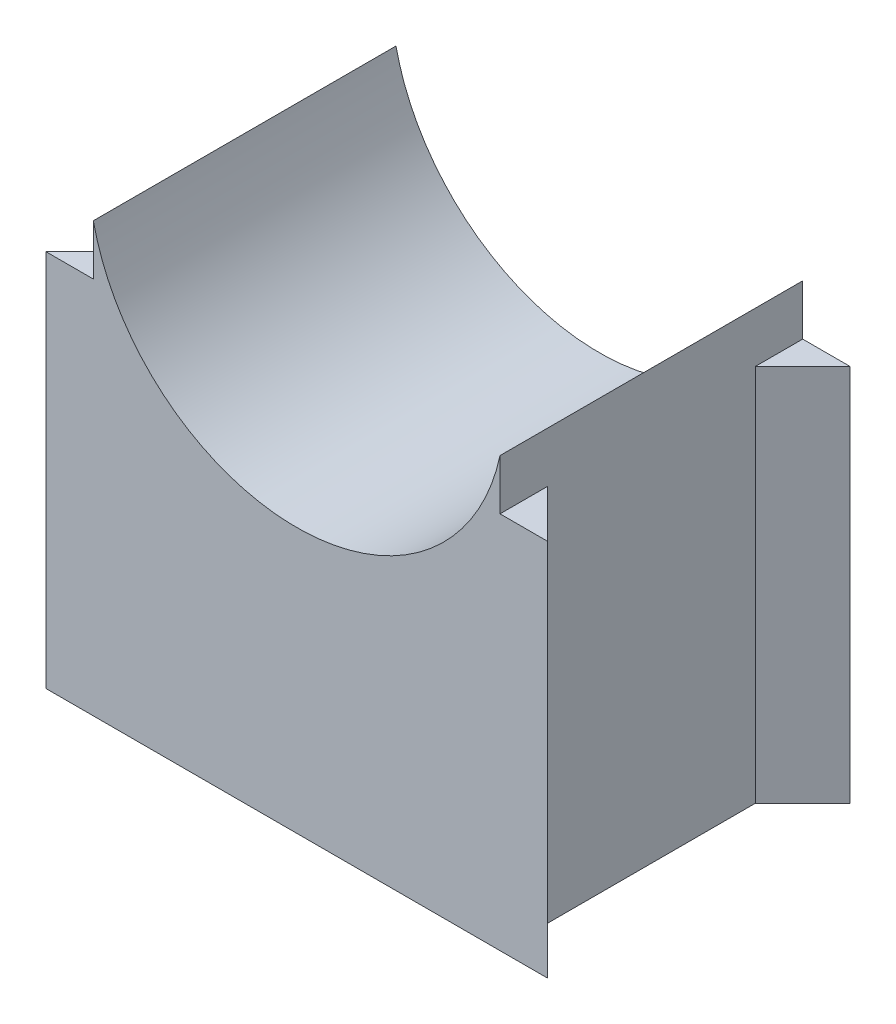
from build123d import *

# Parameters (mm, degrees)
AUFSATZ_LINEAR_AUSTRAGEN1_DEPTH = 16
AUFSATZ_LINEAR_AUSTRAGEN2_DEPTH = 20


with BuildPart() as part:
    # Skizze3 → Aufsatz-Linear austragen1 (new body)
    with BuildSketch(Plane.XY):
        with BuildLine():
            Line((10.75, 0), (-10.75, 0))
            Line((-10.75, 0), (-10.75, 22.668155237))
            ThreePointArc((-10.75, 22.668155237), (0, 14), (10.75, 22.668155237))
            Line((10.75, 22.668155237), (10.75, 0))
        make_face()
    extrude(amount=AUFSATZ_LINEAR_AUSTRAGEN1_DEPTH)

    # Skizze4 → Aufsatz-Linear austragen2 (add)
    with BuildSketch(Plane(origin=(0, 0, 0), x_dir=(-1, 0, 0), z_dir=(0, -1, 0))):
        Polygon((10.75, -16), (13.25, -16), (10.75, -13.5), align=None)
        Polygon((13.25, 0), (10.75, -2.5), (10.75, 0), align=None)
        Polygon((-10.75, 0), (-13.25, 0), (-10.75, -2.5), align=None)
        Polygon((-13.25, -16), (-10.75, -13.5), (-10.75, -16), align=None)
    extrude(amount=-AUFSATZ_LINEAR_AUSTRAGEN2_DEPTH)


solid = part.part
